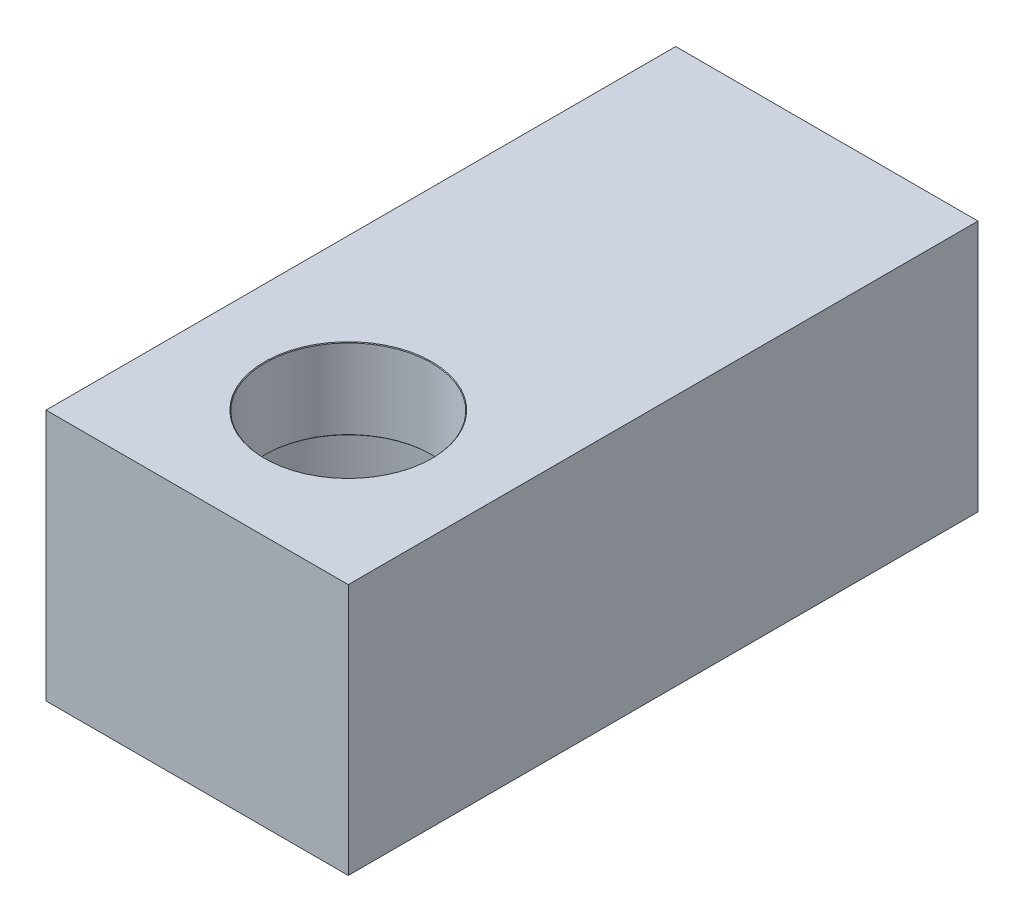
ISO-10303-21;
HEADER;
FILE_DESCRIPTION(('STEP AP214'),'2;1');
FILE_NAME('part.step','',(''),(''),'','','');
FILE_SCHEMA(('AUTOMOTIVE_DESIGN { 1 0 10303 214 1 1 1 1 }'));
ENDSEC;
DATA;
#1=APPLICATION_CONTEXT('core data for automotive mechanical design processes');
#2=APPLICATION_PROTOCOL_DEFINITION('international standard','automotive_design',2000,#1);
#3=PRODUCT_CONTEXT('',#1,'mechanical');
#4=PRODUCT('Part','Part','',(#3));
#5=PRODUCT_RELATED_PRODUCT_CATEGORY('part','',(#4));
#6=PRODUCT_DEFINITION_FORMATION('','',#4);
#7=PRODUCT_DEFINITION_CONTEXT('part definition',#1,'design');
#8=PRODUCT_DEFINITION('design','',#6,#7);
#9=PRODUCT_DEFINITION_SHAPE('','',#8);
#10=(LENGTH_UNIT() NAMED_UNIT(*) SI_UNIT(.MILLI.,.METRE.));
#11=(NAMED_UNIT(*) PLANE_ANGLE_UNIT() SI_UNIT($,.RADIAN.));
#12=(NAMED_UNIT(*) SI_UNIT($,.STERADIAN.) SOLID_ANGLE_UNIT());
#13=UNCERTAINTY_MEASURE_WITH_UNIT(LENGTH_MEASURE(1.E-05),#10,'distance_accuracy_value','');
#14=(GEOMETRIC_REPRESENTATION_CONTEXT(3) GLOBAL_UNCERTAINTY_ASSIGNED_CONTEXT((#13)) GLOBAL_UNIT_ASSIGNED_CONTEXT((#10,
#11,#12)) REPRESENTATION_CONTEXT('',''));
#15=CARTESIAN_POINT('',(0.,0.,0.));
#16=DIRECTION('',(0.,0.,1.));
#17=DIRECTION('',(1.,0.,0.));
#18=AXIS2_PLACEMENT_3D('',#15,#16,#17);
#19=CARTESIAN_POINT('',(81.7970110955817,-83.6360584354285,-23.));
#20=DIRECTION('',(-1.,0.,0.));
#21=DIRECTION('',(0.,0.,1.));
#22=AXIS2_PLACEMENT_3D('',#19,#20,#21);
#23=PLANE('',#22);
#24=DIRECTION('',(0.,0.,1.));
#25=VECTOR('',#24,1.);
#26=CARTESIAN_POINT('',(81.7970110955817,-89.6360584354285,-23.));
#27=LINE('',#26,#25);
#28=CARTESIAN_POINT('',(81.7970110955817,-89.6360584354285,-23.));
#29=VERTEX_POINT('',#28);
#30=CARTESIAN_POINT('',(81.7970110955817,-89.6360584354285,2.));
#31=VERTEX_POINT('',#30);
#32=EDGE_CURVE('E55',#29,#31,#27,.T.);
#33=ORIENTED_EDGE('',*,*,#32,.F.);
#34=DIRECTION('',(0.,-1.,0.));
#35=VECTOR('',#34,1.);
#36=CARTESIAN_POINT('',(81.7970110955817,-83.6360584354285,-23.));
#37=LINE('',#36,#35);
#38=CARTESIAN_POINT('',(81.7970110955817,-99.6360584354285,-23.));
#39=VERTEX_POINT('',#38);
#40=EDGE_CURVE('E36',#29,#39,#37,.T.);
#41=ORIENTED_EDGE('',*,*,#40,.T.);
#42=DIRECTION('',(0.,0.,1.));
#43=VECTOR('',#42,1.);
#44=CARTESIAN_POINT('',(81.7970110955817,-99.6360584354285,-23.));
#45=LINE('',#44,#43);
#46=CARTESIAN_POINT('',(81.7970110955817,-99.6360584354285,2.));
#47=VERTEX_POINT('',#46);
#48=EDGE_CURVE('E19',#39,#47,#45,.T.);
#49=ORIENTED_EDGE('',*,*,#48,.T.);
#50=DIRECTION('',(0.,-1.,0.));
#51=VECTOR('',#50,1.);
#52=CARTESIAN_POINT('',(81.7970110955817,-89.6360584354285,2.));
#53=LINE('',#52,#51);
#54=EDGE_CURVE('E66',#31,#47,#53,.T.);
#55=ORIENTED_EDGE('',*,*,#54,.F.);
#56=EDGE_LOOP('',(#33,#41,#49,#55));
#57=FACE_BOUND('',#56,.T.);
#58=ADVANCED_FACE('F16',(#57),#23,.T.);
#59=CARTESIAN_POINT('',(93.7970110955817,-83.6360584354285,-23.));
#60=DIRECTION('',(1.,0.,0.));
#61=DIRECTION('',(0.,0.,-1.));
#62=AXIS2_PLACEMENT_3D('',#59,#60,#61);
#63=PLANE('',#62);
#64=DIRECTION('',(0.,0.,1.));
#65=VECTOR('',#64,1.);
#66=CARTESIAN_POINT('',(93.7970110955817,-89.6360584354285,-23.));
#67=LINE('',#66,#65);
#68=CARTESIAN_POINT('',(93.7970110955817,-89.6360584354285,-23.));
#69=VERTEX_POINT('',#68);
#70=CARTESIAN_POINT('',(93.7970110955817,-89.6360584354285,2.));
#71=VERTEX_POINT('',#70);
#72=EDGE_CURVE('E62',#69,#71,#67,.T.);
#73=ORIENTED_EDGE('',*,*,#72,.T.);
#74=DIRECTION('',(0.,1.,0.));
#75=VECTOR('',#74,1.);
#76=CARTESIAN_POINT('',(93.7970110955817,-99.6360584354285,2.));
#77=LINE('',#76,#75);
#78=CARTESIAN_POINT('',(93.7970110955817,-99.6360584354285,2.));
#79=VERTEX_POINT('',#78);
#80=EDGE_CURVE('E63',#79,#71,#77,.T.);
#81=ORIENTED_EDGE('',*,*,#80,.F.);
#82=DIRECTION('',(0.,0.,1.));
#83=VECTOR('',#82,1.);
#84=CARTESIAN_POINT('',(93.7970110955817,-99.6360584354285,-23.));
#85=LINE('',#84,#83);
#86=CARTESIAN_POINT('',(93.7970110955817,-99.6360584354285,-23.));
#87=VERTEX_POINT('',#86);
#88=EDGE_CURVE('E11',#87,#79,#85,.T.);
#89=ORIENTED_EDGE('',*,*,#88,.F.);
#90=DIRECTION('',(0.,1.,0.));
#91=VECTOR('',#90,1.);
#92=CARTESIAN_POINT('',(93.7970110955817,-83.6360584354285,-23.));
#93=LINE('',#92,#91);
#94=EDGE_CURVE('E89',#87,#69,#93,.T.);
#95=ORIENTED_EDGE('',*,*,#94,.T.);
#96=EDGE_LOOP('',(#73,#81,#89,#95));
#97=FACE_BOUND('',#96,.T.);
#98=ADVANCED_FACE('F90',(#97),#63,.T.);
#99=CARTESIAN_POINT('',(81.7970110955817,-99.6360584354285,-23.));
#100=DIRECTION('',(0.,-1.,0.));
#101=DIRECTION('',(0.,0.,-1.));
#102=AXIS2_PLACEMENT_3D('',#99,#100,#101);
#103=PLANE('',#102);
#104=CARTESIAN_POINT('',(87.7970110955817,-99.6360584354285,-4.));
#105=DIRECTION('',(0.,-1.,0.));
#106=DIRECTION('',(0.,0.,-1.));
#107=AXIS2_PLACEMENT_3D('',#104,#105,#106);
#108=CIRCLE('',#107,5.525);
#109=CARTESIAN_POINT('',(87.7970110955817,-99.6360584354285,-9.525));
#110=VERTEX_POINT('',#109);
#111=EDGE_CURVE('E217',#110,#110,#108,.T.);
#112=ORIENTED_EDGE('',*,*,#111,.F.);
#113=EDGE_LOOP('',(#112));
#114=FACE_BOUND('',#113,.T.);
#115=ORIENTED_EDGE('',*,*,#88,.T.);
#116=DIRECTION('',(1.,0.,0.));
#117=VECTOR('',#116,1.);
#118=CARTESIAN_POINT('',(81.7970110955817,-99.6360584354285,2.));
#119=LINE('',#118,#117);
#120=EDGE_CURVE('E70',#47,#79,#119,.T.);
#121=ORIENTED_EDGE('',*,*,#120,.F.);
#122=ORIENTED_EDGE('',*,*,#48,.F.);
#123=DIRECTION('',(1.,0.,0.));
#124=VECTOR('',#123,1.);
#125=CARTESIAN_POINT('',(81.7970110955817,-99.6360584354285,-23.));
#126=LINE('',#125,#124);
#127=EDGE_CURVE('E86',#39,#87,#126,.T.);
#128=ORIENTED_EDGE('',*,*,#127,.T.);
#129=EDGE_LOOP('',(#115,#121,#122,#128));
#130=FACE_BOUND('',#129,.T.);
#131=ADVANCED_FACE('F95',(#114,#130),#103,.T.);
#132=CARTESIAN_POINT('',(0.,0.,-23.));
#133=DIRECTION('',(0.,0.,1.));
#134=DIRECTION('',(1.,0.,0.));
#135=AXIS2_PLACEMENT_3D('',#132,#133,#134);
#136=PLANE('',#135);
#137=ORIENTED_EDGE('',*,*,#40,.F.);
#138=DIRECTION('',(-1.,0.,0.));
#139=VECTOR('',#138,1.);
#140=CARTESIAN_POINT('',(93.7970110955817,-89.6360584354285,-23.));
#141=LINE('',#140,#139);
#142=EDGE_CURVE('E61',#69,#29,#141,.T.);
#143=ORIENTED_EDGE('',*,*,#142,.F.);
#144=ORIENTED_EDGE('',*,*,#94,.F.);
#145=ORIENTED_EDGE('',*,*,#127,.F.);
#146=EDGE_LOOP('',(#137,#143,#144,#145));
#147=FACE_BOUND('',#146,.T.);
#148=ADVANCED_FACE('F93',(#147),#136,.F.);
#149=CARTESIAN_POINT('',(93.7970110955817,-89.6360584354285,-23.));
#150=DIRECTION('',(0.,-1.,0.));
#151=DIRECTION('',(0.,0.,-1.));
#152=AXIS2_PLACEMENT_3D('',#149,#150,#151);
#153=PLANE('',#152);
#154=CARTESIAN_POINT('',(87.7970110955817,-89.6360584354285,-4.));
#155=DIRECTION('',(0.,-1.,0.));
#156=DIRECTION('',(0.,0.,-1.));
#157=AXIS2_PLACEMENT_3D('',#154,#155,#156);
#158=CIRCLE('',#157,3.325);
#159=CARTESIAN_POINT('',(87.7970110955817,-89.6360584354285,-7.325));
#160=VERTEX_POINT('',#159);
#161=EDGE_CURVE('E218',#160,#160,#158,.T.);
#162=ORIENTED_EDGE('',*,*,#161,.T.);
#163=EDGE_LOOP('',(#162));
#164=FACE_BOUND('',#163,.T.);
#165=ORIENTED_EDGE('',*,*,#32,.T.);
#166=DIRECTION('',(-1.,0.,0.));
#167=VECTOR('',#166,1.);
#168=CARTESIAN_POINT('',(93.7970110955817,-89.6360584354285,2.));
#169=LINE('',#168,#167);
#170=EDGE_CURVE('E59',#71,#31,#169,.T.);
#171=ORIENTED_EDGE('',*,*,#170,.F.);
#172=ORIENTED_EDGE('',*,*,#72,.F.);
#173=ORIENTED_EDGE('',*,*,#142,.T.);
#174=EDGE_LOOP('',(#165,#171,#172,#173));
#175=FACE_BOUND('',#174,.T.);
#176=ADVANCED_FACE('F57',(#164,#175),#153,.F.);
#177=CARTESIAN_POINT('',(0.,0.,2.));
#178=DIRECTION('',(0.,0.,1.));
#179=DIRECTION('',(1.,0.,0.));
#180=AXIS2_PLACEMENT_3D('',#177,#178,#179);
#181=PLANE('',#180);
#182=ORIENTED_EDGE('',*,*,#170,.T.);
#183=ORIENTED_EDGE('',*,*,#54,.T.);
#184=ORIENTED_EDGE('',*,*,#120,.T.);
#185=ORIENTED_EDGE('',*,*,#80,.T.);
#186=EDGE_LOOP('',(#182,#183,#184,#185));
#187=FACE_BOUND('',#186,.T.);
#188=ADVANCED_FACE('F73',(#187),#181,.T.);
#189=CARTESIAN_POINT('',(87.7970110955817,-89.6610584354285,-4.));
#190=DIRECTION('',(0.,1.,0.));
#191=DIRECTION('',(0.,0.,1.));
#192=AXIS2_PLACEMENT_3D('',#189,#190,#191);
#193=CONICAL_SURFACE('',#192,3.3,0.785398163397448);
#194=ORIENTED_EDGE('',*,*,#161,.F.);
#195=EDGE_LOOP('',(#194));
#196=FACE_BOUND('',#195,.T.);
#197=CARTESIAN_POINT('',(87.7970110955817,-89.6610584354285,-4.));
#198=DIRECTION('',(0.,-1.,0.));
#199=DIRECTION('',(0.,0.,-1.));
#200=AXIS2_PLACEMENT_3D('',#197,#198,#199);
#201=CIRCLE('',#200,3.3);
#202=CARTESIAN_POINT('',(87.7970110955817,-89.6610584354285,-7.3));
#203=VERTEX_POINT('',#202);
#204=EDGE_CURVE('E74',#203,#203,#201,.T.);
#205=ORIENTED_EDGE('',*,*,#204,.T.);
#206=EDGE_LOOP('',(#205));
#207=FACE_BOUND('',#206,.T.);
#208=ADVANCED_FACE('F148',(#196,#207),#193,.F.);
#209=CARTESIAN_POINT('',(87.7970110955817,-99.6360584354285,-4.));
#210=DIRECTION('',(0.,-1.,0.));
#211=DIRECTION('',(0.,0.,-1.));
#212=AXIS2_PLACEMENT_3D('',#209,#210,#211);
#213=CYLINDRICAL_SURFACE('',#212,3.3);
#214=ORIENTED_EDGE('',*,*,#204,.F.);
#215=EDGE_LOOP('',(#214));
#216=FACE_BOUND('',#215,.T.);
#217=CARTESIAN_POINT('',(87.7970110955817,-92.8110584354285,-4.));
#218=DIRECTION('',(0.,-1.,0.));
#219=DIRECTION('',(0.,0.,-1.));
#220=AXIS2_PLACEMENT_3D('',#217,#218,#219);
#221=CIRCLE('',#220,3.3);
#222=CARTESIAN_POINT('',(87.7970110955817,-92.8110584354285,-7.3));
#223=VERTEX_POINT('',#222);
#224=EDGE_CURVE('E77',#223,#223,#221,.T.);
#225=ORIENTED_EDGE('',*,*,#224,.T.);
#226=EDGE_LOOP('',(#225));
#227=FACE_BOUND('',#226,.T.);
#228=ADVANCED_FACE('F156',(#216,#227),#213,.F.);
#229=CARTESIAN_POINT('',(87.7970110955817,-92.8360584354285,-4.));
#230=DIRECTION('',(0.,-1.,0.));
#231=DIRECTION('',(0.,0.,-1.));
#232=AXIS2_PLACEMENT_3D('',#229,#230,#231);
#233=CONICAL_SURFACE('',#232,3.325,0.785398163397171);
#234=ORIENTED_EDGE('',*,*,#224,.F.);
#235=EDGE_LOOP('',(#234));
#236=FACE_BOUND('',#235,.T.);
#237=CARTESIAN_POINT('',(87.7970110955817,-92.8360584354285,-4.));
#238=DIRECTION('',(0.,-1.,0.));
#239=DIRECTION('',(0.,0.,-1.));
#240=AXIS2_PLACEMENT_3D('',#237,#238,#239);
#241=CIRCLE('',#240,3.325);
#242=CARTESIAN_POINT('',(87.7970110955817,-92.8360584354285,-7.325));
#243=VERTEX_POINT('',#242);
#244=EDGE_CURVE('E227',#243,#243,#241,.T.);
#245=ORIENTED_EDGE('',*,*,#244,.T.);
#246=EDGE_LOOP('',(#245));
#247=FACE_BOUND('',#246,.T.);
#248=ADVANCED_FACE('F166',(#236,#247),#233,.F.);
#249=CARTESIAN_POINT('',(91.1220110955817,-92.8360584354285,-4.));
#250=DIRECTION('',(0.,1.,0.));
#251=DIRECTION('',(0.,0.,1.));
#252=AXIS2_PLACEMENT_3D('',#249,#250,#251);
#253=PLANE('',#252);
#254=ORIENTED_EDGE('',*,*,#244,.F.);
#255=EDGE_LOOP('',(#254));
#256=FACE_BOUND('',#255,.T.);
#257=CARTESIAN_POINT('',(87.7970110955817,-92.8360584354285,-4.));
#258=DIRECTION('',(0.,-1.,0.));
#259=DIRECTION('',(0.,0.,-1.));
#260=AXIS2_PLACEMENT_3D('',#257,#258,#259);
#261=CIRCLE('',#260,5.5);
#262=CARTESIAN_POINT('',(87.7970110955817,-92.8360584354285,-9.5));
#263=VERTEX_POINT('',#262);
#264=EDGE_CURVE('E220',#263,#263,#261,.T.);
#265=ORIENTED_EDGE('',*,*,#264,.T.);
#266=EDGE_LOOP('',(#265));
#267=FACE_BOUND('',#266,.T.);
#268=ADVANCED_FACE('F176',(#256,#267),#253,.F.);
#269=CARTESIAN_POINT('',(87.7970110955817,-99.6360584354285,-4.));
#270=DIRECTION('',(0.,-1.,0.));
#271=DIRECTION('',(0.,0.,-1.));
#272=AXIS2_PLACEMENT_3D('',#269,#270,#271);
#273=CYLINDRICAL_SURFACE('',#272,5.5);
#274=ORIENTED_EDGE('',*,*,#264,.F.);
#275=EDGE_LOOP('',(#274));
#276=FACE_BOUND('',#275,.T.);
#277=CARTESIAN_POINT('',(87.7970110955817,-99.6110584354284,-4.));
#278=DIRECTION('',(0.,-1.,0.));
#279=DIRECTION('',(0.,0.,-1.));
#280=AXIS2_PLACEMENT_3D('',#277,#278,#279);
#281=CIRCLE('',#280,5.5);
#282=CARTESIAN_POINT('',(87.7970110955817,-99.6110584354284,-9.5));
#283=VERTEX_POINT('',#282);
#284=EDGE_CURVE('E215',#283,#283,#281,.T.);
#285=ORIENTED_EDGE('',*,*,#284,.T.);
#286=EDGE_LOOP('',(#285));
#287=FACE_BOUND('',#286,.T.);
#288=ADVANCED_FACE('F186',(#276,#287),#273,.F.);
#289=CARTESIAN_POINT('',(87.7970110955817,-99.6360584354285,-4.));
#290=DIRECTION('',(0.,-1.,0.));
#291=DIRECTION('',(0.,0.,-1.));
#292=AXIS2_PLACEMENT_3D('',#289,#290,#291);
#293=CONICAL_SURFACE('',#292,5.525,0.785398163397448);
#294=ORIENTED_EDGE('',*,*,#284,.F.);
#295=EDGE_LOOP('',(#294));
#296=FACE_BOUND('',#295,.T.);
#297=ORIENTED_EDGE('',*,*,#111,.T.);
#298=EDGE_LOOP('',(#297));
#299=FACE_BOUND('',#298,.T.);
#300=ADVANCED_FACE('F196',(#296,#299),#293,.F.);
#301=CLOSED_SHELL('',(#58,#98,#131,#148,#176,#188,#208,#228,#248,#268,#288,#300));
#302=MANIFOLD_SOLID_BREP('B1',#301);
#303=ADVANCED_BREP_SHAPE_REPRESENTATION('',(#18,#302),#14);
#304=SHAPE_DEFINITION_REPRESENTATION(#9,#303);
ENDSEC;
END-ISO-10303-21;
